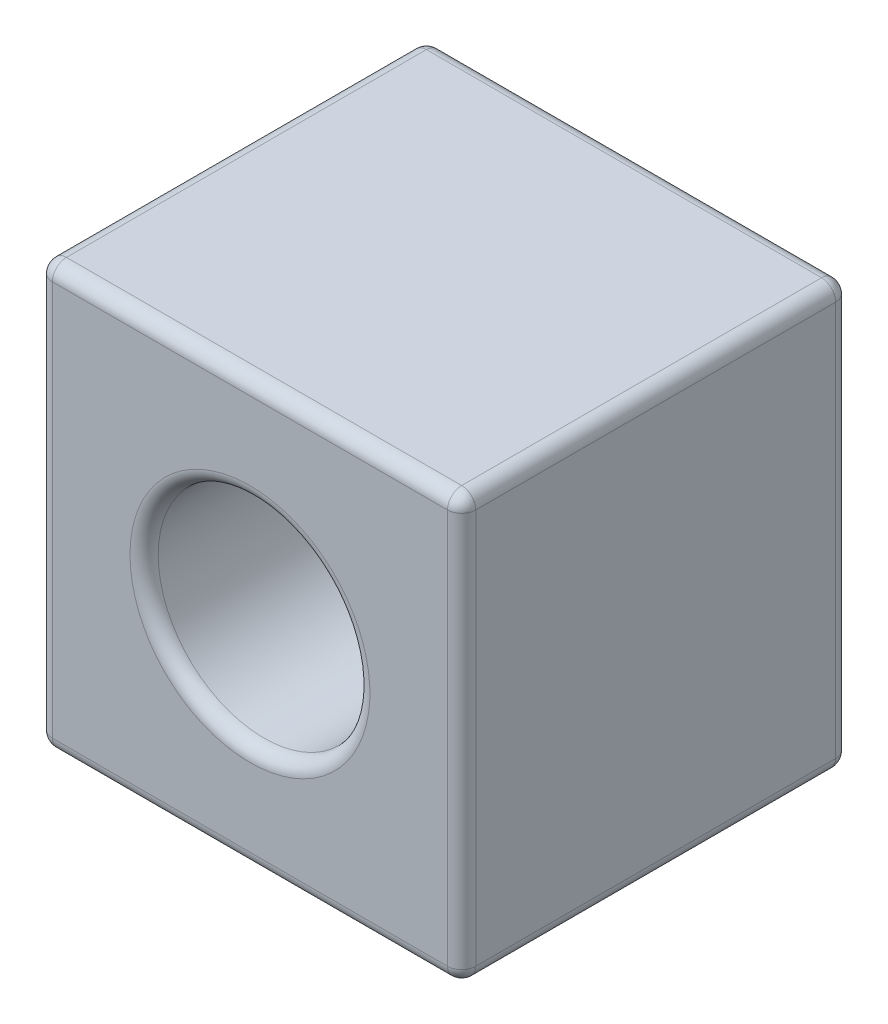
from build123d import *

# Parameters (mm, degrees)
ESQUISSE1_R      = 1.5
EXTRUSION1_DEPTH = 5.5
CONG_1_R         = 0.2


with BuildPart() as part:
    # Esquisse1 → Extrusion1 (new body)
    with BuildSketch(Plane.XY):
        with BuildLine():
            Line((-2.8, 3), (2.8, 3))
            ThreePointArc((2.8, 3), (2.941421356, 2.941421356), (3, 2.8))
            Line((3, 2.8), (3, -2.8))
            ThreePointArc((3, -2.8), (2.941421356, -2.941421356), (2.8, -3))
            Line((2.8, -3), (-2.8, -3))
            ThreePointArc((-2.8, -3), (-2.941421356, -2.941421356), (-3, -2.8))
            Line((-3, -2.8), (-3, 2.8))
            ThreePointArc((-3, 2.8), (-2.941421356, 2.941421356), (-2.8, 3))
        make_face()
        with Locations(Location((0, 0, 0), (0, 0, 180))):
            Circle(ESQUISSE1_R, mode=Mode.SUBTRACT)
    extrude(amount=EXTRUSION1_DEPTH)

    # Cong_1
    cong_1_edges = [part.edges().sort_by_distance(p)[0] for p in [
        (0, 3, 0),
        (0, 3, 5.5),
        (2.941421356, 2.941421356, 0),
        (2.941421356, 2.941421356, 5.5),
        (3, 0, 0),
        (3, 0, 5.5),
        (2.941421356, -2.941421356, 0),
        (2.941421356, -2.941421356, 5.5),
        (0, -3, 0),
        (0, -3, 5.5),
        (-2.941421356, -2.941421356, 0),
        (-2.941421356, -2.941421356, 5.5),
        (-3, 0, 0),
        (-3, 0, 5.5),
        (-2.941421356, 2.941421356, 0),
        (-2.941421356, 2.941421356, 5.5),
        (1.5, 0, 0),
        (1.5, 0, 5.5),
    ]]
    fillet(cong_1_edges, radius=CONG_1_R)


solid = part.part
